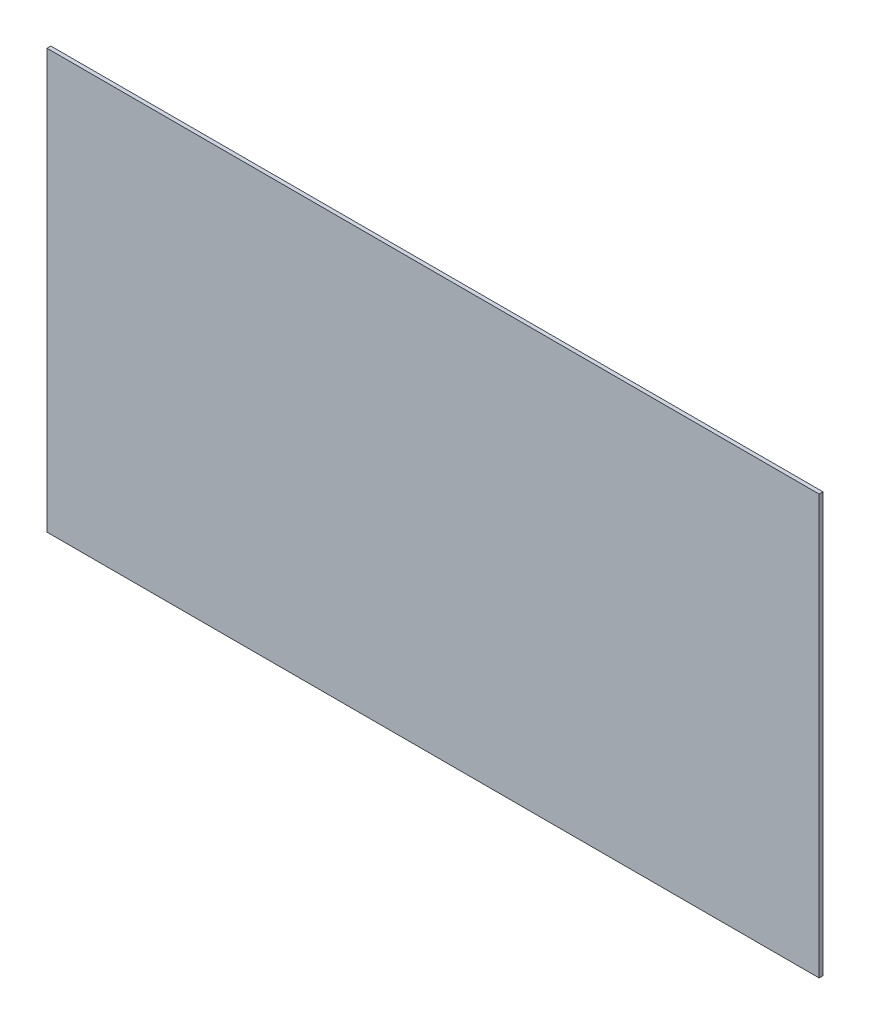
from build123d import *

# Parameters (mm, degrees)
SKETCH1_W           = 200
SKETCH1_H           = 108.550426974
BOSS_EXTRUDE1_DEPTH = 1


with BuildPart() as part:
    # Sketch1 → Boss-Extrude1 (new body)
    with BuildSketch(Plane.XY):
        with Locations((25.922403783, 1.383605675)):
            Rectangle(SKETCH1_W, SKETCH1_H)
    extrude(amount=BOSS_EXTRUDE1_DEPTH)


solid = part.part
